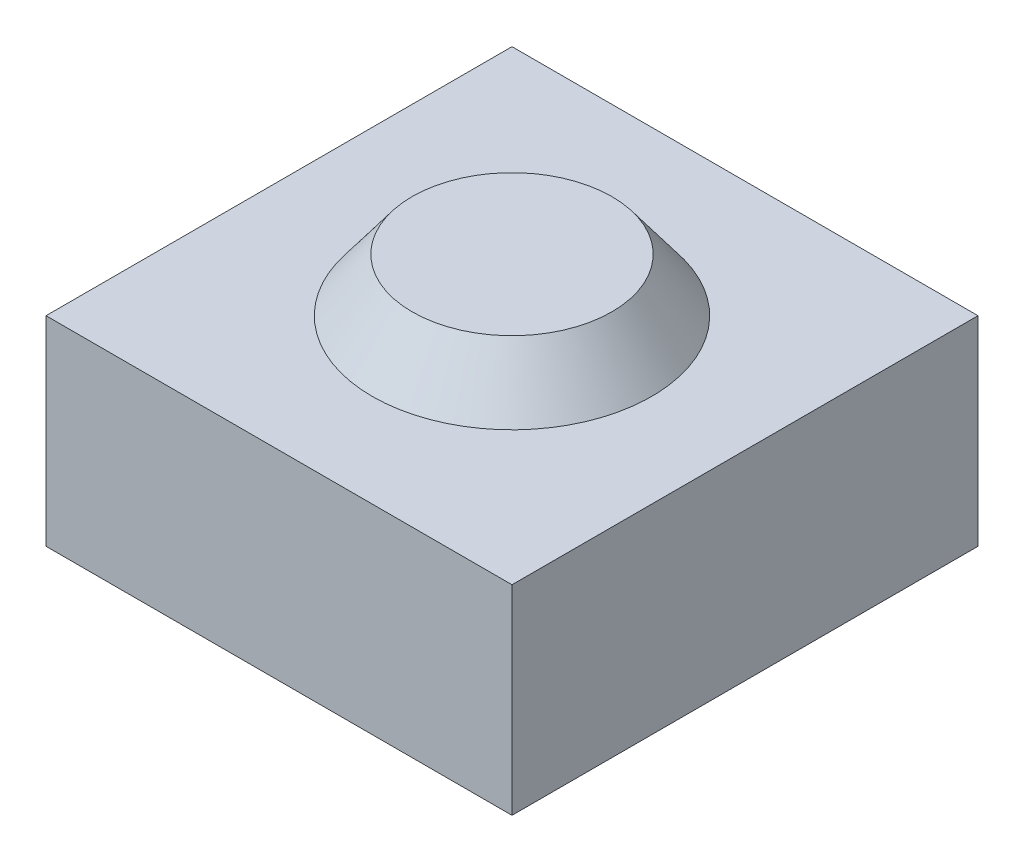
ISO-10303-21;
HEADER;
FILE_DESCRIPTION(('STEP AP214'),'2;1');
FILE_NAME('part.step','',(''),(''),'','','');
FILE_SCHEMA(('AUTOMOTIVE_DESIGN { 1 0 10303 214 1 1 1 1 }'));
ENDSEC;
DATA;
#1=APPLICATION_CONTEXT('core data for automotive mechanical design processes');
#2=APPLICATION_PROTOCOL_DEFINITION('international standard','automotive_design',2000,#1);
#3=PRODUCT_CONTEXT('',#1,'mechanical');
#4=PRODUCT('Part','Part','',(#3));
#5=PRODUCT_RELATED_PRODUCT_CATEGORY('part','',(#4));
#6=PRODUCT_DEFINITION_FORMATION('','',#4);
#7=PRODUCT_DEFINITION_CONTEXT('part definition',#1,'design');
#8=PRODUCT_DEFINITION('design','',#6,#7);
#9=PRODUCT_DEFINITION_SHAPE('','',#8);
#10=(LENGTH_UNIT() NAMED_UNIT(*) SI_UNIT(.MILLI.,.METRE.));
#11=(NAMED_UNIT(*) PLANE_ANGLE_UNIT() SI_UNIT($,.RADIAN.));
#12=(NAMED_UNIT(*) SI_UNIT($,.STERADIAN.) SOLID_ANGLE_UNIT());
#13=UNCERTAINTY_MEASURE_WITH_UNIT(LENGTH_MEASURE(1.E-05),#10,'distance_accuracy_value','');
#14=(GEOMETRIC_REPRESENTATION_CONTEXT(3) GLOBAL_UNCERTAINTY_ASSIGNED_CONTEXT((#13)) GLOBAL_UNIT_ASSIGNED_CONTEXT((#10,
#11,#12)) REPRESENTATION_CONTEXT('',''));
#15=CARTESIAN_POINT('',(0.,0.,0.));
#16=DIRECTION('',(0.,0.,1.));
#17=DIRECTION('',(1.,0.,0.));
#18=AXIS2_PLACEMENT_3D('',#15,#16,#17);
#19=CARTESIAN_POINT('',(0.,4.,0.));
#20=DIRECTION('',(0.,-1.,0.));
#21=DIRECTION('',(0.,0.,-1.));
#22=AXIS2_PLACEMENT_3D('',#19,#20,#21);
#23=PLANE('',#22);
#24=CARTESIAN_POINT('',(0.,4.,0.));
#25=DIRECTION('',(0.,-1.,0.));
#26=DIRECTION('',(0.,0.,-1.));
#27=AXIS2_PLACEMENT_3D('',#24,#25,#26);
#28=CIRCLE('',#27,7.5);
#29=CARTESIAN_POINT('',(0.,4.,-7.5));
#30=VERTEX_POINT('',#29);
#31=EDGE_CURVE('E11',#30,#30,#28,.T.);
#32=ORIENTED_EDGE('',*,*,#31,.F.);
#33=EDGE_LOOP('',(#32));
#34=FACE_BOUND('',#33,.T.);
#35=ADVANCED_FACE('F37',(#34),#23,.F.);
#36=CARTESIAN_POINT('',(0.,4.,0.));
#37=DIRECTION('',(0.,-1.,0.));
#38=DIRECTION('',(0.,0.,-1.));
#39=AXIS2_PLACEMENT_3D('',#36,#37,#38);
#40=CONICAL_SURFACE('',#39,7.5,0.643501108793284);
#41=CARTESIAN_POINT('',(0.,0.,0.));
#42=DIRECTION('',(0.,-1.,0.));
#43=DIRECTION('',(0.,0.,-1.));
#44=AXIS2_PLACEMENT_3D('',#41,#42,#43);
#45=CIRCLE('',#44,10.5);
#46=CARTESIAN_POINT('',(0.,0.,-10.5));
#47=VERTEX_POINT('',#46);
#48=EDGE_CURVE('E45',#47,#47,#45,.T.);
#49=ORIENTED_EDGE('',*,*,#48,.F.);
#50=EDGE_LOOP('',(#49));
#51=FACE_BOUND('',#50,.T.);
#52=ORIENTED_EDGE('',*,*,#31,.T.);
#53=EDGE_LOOP('',(#52));
#54=FACE_BOUND('',#53,.T.);
#55=ADVANCED_FACE('F118',(#51,#54),#40,.T.);
#56=CARTESIAN_POINT('',(17.5,-15.,-17.5));
#57=DIRECTION('',(-1.,0.,0.));
#58=DIRECTION('',(0.,0.,1.));
#59=AXIS2_PLACEMENT_3D('',#56,#57,#58);
#60=PLANE('',#59);
#61=DIRECTION('',(0.,0.,1.));
#62=VECTOR('',#61,1.);
#63=CARTESIAN_POINT('',(17.5,0.,-17.5));
#64=LINE('',#63,#62);
#65=CARTESIAN_POINT('',(17.5,0.,-17.5));
#66=VERTEX_POINT('',#65);
#67=CARTESIAN_POINT('',(17.5,0.,17.5));
#68=VERTEX_POINT('',#67);
#69=EDGE_CURVE('E104',#66,#68,#64,.T.);
#70=ORIENTED_EDGE('',*,*,#69,.T.);
#71=DIRECTION('',(0.,1.,0.));
#72=VECTOR('',#71,1.);
#73=CARTESIAN_POINT('',(17.5,-15.,17.5));
#74=LINE('',#73,#72);
#75=CARTESIAN_POINT('',(17.5,-15.,17.5));
#76=VERTEX_POINT('',#75);
#77=EDGE_CURVE('E95',#76,#68,#74,.T.);
#78=ORIENTED_EDGE('',*,*,#77,.F.);
#79=DIRECTION('',(0.,0.,1.));
#80=VECTOR('',#79,1.);
#81=CARTESIAN_POINT('',(17.5,-15.,-17.5));
#82=LINE('',#81,#80);
#83=CARTESIAN_POINT('',(17.5,-15.,-17.5));
#84=VERTEX_POINT('',#83);
#85=EDGE_CURVE('E89',#84,#76,#82,.T.);
#86=ORIENTED_EDGE('',*,*,#85,.F.);
#87=DIRECTION('',(0.,1.,0.));
#88=VECTOR('',#87,1.);
#89=CARTESIAN_POINT('',(17.5,-15.,-17.5));
#90=LINE('',#89,#88);
#91=EDGE_CURVE('E100',#84,#66,#90,.T.);
#92=ORIENTED_EDGE('',*,*,#91,.T.);
#93=EDGE_LOOP('',(#70,#78,#86,#92));
#94=FACE_BOUND('',#93,.T.);
#95=ADVANCED_FACE('F121',(#94),#60,.F.);
#96=CARTESIAN_POINT('',(-17.5,-15.,17.5));
#97=DIRECTION('',(0.,0.,-1.));
#98=DIRECTION('',(-1.,0.,0.));
#99=AXIS2_PLACEMENT_3D('',#96,#97,#98);
#100=PLANE('',#99);
#101=DIRECTION('',(-1.,0.,0.));
#102=VECTOR('',#101,1.);
#103=CARTESIAN_POINT('',(-17.5,0.,17.5));
#104=LINE('',#103,#102);
#105=CARTESIAN_POINT('',(-17.5,0.,17.5));
#106=VERTEX_POINT('',#105);
#107=EDGE_CURVE('E94',#68,#106,#104,.T.);
#108=ORIENTED_EDGE('',*,*,#107,.T.);
#109=DIRECTION('',(0.,1.,0.));
#110=VECTOR('',#109,1.);
#111=CARTESIAN_POINT('',(-17.5,-15.,17.5));
#112=LINE('',#111,#110);
#113=CARTESIAN_POINT('',(-17.5,-15.,17.5));
#114=VERTEX_POINT('',#113);
#115=EDGE_CURVE('E92',#114,#106,#112,.T.);
#116=ORIENTED_EDGE('',*,*,#115,.F.);
#117=DIRECTION('',(-1.,0.,0.));
#118=VECTOR('',#117,1.);
#119=CARTESIAN_POINT('',(-17.5,-15.,17.5));
#120=LINE('',#119,#118);
#121=EDGE_CURVE('E84',#76,#114,#120,.T.);
#122=ORIENTED_EDGE('',*,*,#121,.F.);
#123=ORIENTED_EDGE('',*,*,#77,.T.);
#124=EDGE_LOOP('',(#108,#116,#122,#123));
#125=FACE_BOUND('',#124,.T.);
#126=ADVANCED_FACE('F93',(#125),#100,.F.);
#127=CARTESIAN_POINT('',(-17.5,-15.,-17.5));
#128=DIRECTION('',(1.,0.,0.));
#129=DIRECTION('',(0.,0.,-1.));
#130=AXIS2_PLACEMENT_3D('',#127,#128,#129);
#131=PLANE('',#130);
#132=DIRECTION('',(0.,0.,-1.));
#133=VECTOR('',#132,1.);
#134=CARTESIAN_POINT('',(-17.5,0.,-17.5));
#135=LINE('',#134,#133);
#136=CARTESIAN_POINT('',(-17.5,0.,-17.5));
#137=VERTEX_POINT('',#136);
#138=EDGE_CURVE('E70',#106,#137,#135,.T.);
#139=ORIENTED_EDGE('',*,*,#138,.T.);
#140=DIRECTION('',(0.,1.,0.));
#141=VECTOR('',#140,1.);
#142=CARTESIAN_POINT('',(-17.5,-15.,-17.5));
#143=LINE('',#142,#141);
#144=CARTESIAN_POINT('',(-17.5,-15.,-17.5));
#145=VERTEX_POINT('',#144);
#146=EDGE_CURVE('E96',#145,#137,#143,.T.);
#147=ORIENTED_EDGE('',*,*,#146,.F.);
#148=DIRECTION('',(0.,0.,-1.));
#149=VECTOR('',#148,1.);
#150=CARTESIAN_POINT('',(-17.5,-15.,-17.5));
#151=LINE('',#150,#149);
#152=EDGE_CURVE('E87',#114,#145,#151,.T.);
#153=ORIENTED_EDGE('',*,*,#152,.F.);
#154=ORIENTED_EDGE('',*,*,#115,.T.);
#155=EDGE_LOOP('',(#139,#147,#153,#154));
#156=FACE_BOUND('',#155,.T.);
#157=ADVANCED_FACE('F98',(#156),#131,.F.);
#158=CARTESIAN_POINT('',(-17.5,-15.,-17.5));
#159=DIRECTION('',(0.,0.,1.));
#160=DIRECTION('',(1.,0.,0.));
#161=AXIS2_PLACEMENT_3D('',#158,#159,#160);
#162=PLANE('',#161);
#163=DIRECTION('',(1.,0.,0.));
#164=VECTOR('',#163,1.);
#165=CARTESIAN_POINT('',(-17.5,0.,-17.5));
#166=LINE('',#165,#164);
#167=EDGE_CURVE('E76',#137,#66,#166,.T.);
#168=ORIENTED_EDGE('',*,*,#167,.T.);
#169=ORIENTED_EDGE('',*,*,#91,.F.);
#170=DIRECTION('',(1.,0.,0.));
#171=VECTOR('',#170,1.);
#172=CARTESIAN_POINT('',(-17.5,-15.,-17.5));
#173=LINE('',#172,#171);
#174=EDGE_CURVE('E53',#145,#84,#173,.T.);
#175=ORIENTED_EDGE('',*,*,#174,.F.);
#176=ORIENTED_EDGE('',*,*,#146,.T.);
#177=EDGE_LOOP('',(#168,#169,#175,#176));
#178=FACE_BOUND('',#177,.T.);
#179=ADVANCED_FACE('F154',(#178),#162,.F.);
#180=CARTESIAN_POINT('',(0.,-15.,0.));
#181=DIRECTION('',(0.,1.,0.));
#182=DIRECTION('',(0.,0.,1.));
#183=AXIS2_PLACEMENT_3D('',#180,#181,#182);
#184=PLANE('',#183);
#185=ORIENTED_EDGE('',*,*,#85,.T.);
#186=ORIENTED_EDGE('',*,*,#121,.T.);
#187=ORIENTED_EDGE('',*,*,#152,.T.);
#188=ORIENTED_EDGE('',*,*,#174,.T.);
#189=EDGE_LOOP('',(#185,#186,#187,#188));
#190=FACE_BOUND('',#189,.T.);
#191=ADVANCED_FACE('F85',(#190),#184,.F.);
#192=CARTESIAN_POINT('',(0.,0.,0.));
#193=DIRECTION('',(0.,1.,0.));
#194=DIRECTION('',(0.,0.,1.));
#195=AXIS2_PLACEMENT_3D('',#192,#193,#194);
#196=PLANE('',#195);
#197=ORIENTED_EDGE('',*,*,#48,.T.);
#198=EDGE_LOOP('',(#197));
#199=FACE_BOUND('',#198,.T.);
#200=ORIENTED_EDGE('',*,*,#69,.F.);
#201=ORIENTED_EDGE('',*,*,#167,.F.);
#202=ORIENTED_EDGE('',*,*,#138,.F.);
#203=ORIENTED_EDGE('',*,*,#107,.F.);
#204=EDGE_LOOP('',(#200,#201,#202,#203));
#205=FACE_BOUND('',#204,.T.);
#206=ADVANCED_FACE('F115',(#199,#205),#196,.T.);
#207=CLOSED_SHELL('',(#35,#55,#95,#126,#157,#179,#191,#206));
#208=MANIFOLD_SOLID_BREP('B2',#207);
#209=ADVANCED_BREP_SHAPE_REPRESENTATION('',(#18,#208),#14);
#210=SHAPE_DEFINITION_REPRESENTATION(#9,#209);
ENDSEC;
END-ISO-10303-21;
